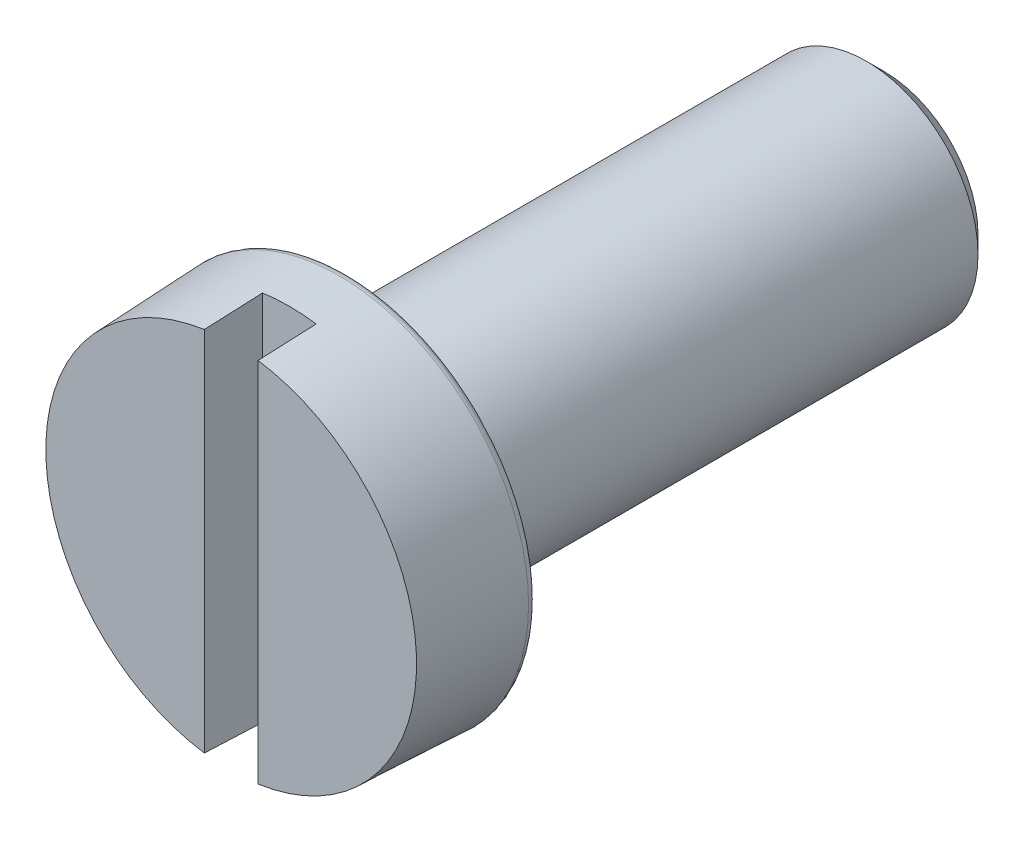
ISO-10303-21;
HEADER;
FILE_DESCRIPTION(('STEP AP214'),'2;1');
FILE_NAME('part.step','',(''),(''),'','','');
FILE_SCHEMA(('AUTOMOTIVE_DESIGN { 1 0 10303 214 1 1 1 1 }'));
ENDSEC;
DATA;
#1=APPLICATION_CONTEXT('core data for automotive mechanical design processes');
#2=APPLICATION_PROTOCOL_DEFINITION('international standard','automotive_design',2000,#1);
#3=PRODUCT_CONTEXT('',#1,'mechanical');
#4=PRODUCT('Part','Part','',(#3));
#5=PRODUCT_RELATED_PRODUCT_CATEGORY('part','',(#4));
#6=PRODUCT_DEFINITION_FORMATION('','',#4);
#7=PRODUCT_DEFINITION_CONTEXT('part definition',#1,'design');
#8=PRODUCT_DEFINITION('design','',#6,#7);
#9=PRODUCT_DEFINITION_SHAPE('','',#8);
#10=(LENGTH_UNIT() NAMED_UNIT(*) SI_UNIT(.MILLI.,.METRE.));
#11=(NAMED_UNIT(*) PLANE_ANGLE_UNIT() SI_UNIT($,.RADIAN.));
#12=(NAMED_UNIT(*) SI_UNIT($,.STERADIAN.) SOLID_ANGLE_UNIT());
#13=UNCERTAINTY_MEASURE_WITH_UNIT(LENGTH_MEASURE(1.E-05),#10,'distance_accuracy_value','');
#14=(GEOMETRIC_REPRESENTATION_CONTEXT(3) GLOBAL_UNCERTAINTY_ASSIGNED_CONTEXT((#13)) GLOBAL_UNIT_ASSIGNED_CONTEXT((#10,
#11,#12)) REPRESENTATION_CONTEXT('',''));
#15=CARTESIAN_POINT('',(0.,0.,0.));
#16=DIRECTION('',(0.,0.,1.));
#17=DIRECTION('',(1.,0.,0.));
#18=AXIS2_PLACEMENT_3D('',#15,#16,#17);
#19=CARTESIAN_POINT('',(0.,0.,2.6));
#20=DIRECTION('',(0.,0.,1.));
#21=DIRECTION('',(1.,0.,0.));
#22=AXIS2_PLACEMENT_3D('',#19,#20,#21);
#23=PLANE('',#22);
#24=DIRECTION('',(0.,1.,0.));
#25=VECTOR('',#24,1.);
#26=CARTESIAN_POINT('',(0.6,0.,2.6));
#27=LINE('',#26,#25);
#28=CARTESIAN_POINT('',(0.6,-4.10156030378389,2.6));
#29=VERTEX_POINT('',#28);
#30=CARTESIAN_POINT('',(0.6,4.10156030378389,2.6));
#31=VERTEX_POINT('',#30);
#32=EDGE_CURVE('E57',#29,#31,#27,.T.);
#33=ORIENTED_EDGE('',*,*,#32,.F.);
#34=CARTESIAN_POINT('',(0.,0.,2.6));
#35=DIRECTION('',(0.,0.,1.));
#36=DIRECTION('',(1.,0.,0.));
#37=AXIS2_PLACEMENT_3D('',#34,#35,#36);
#38=CIRCLE('',#37,4.14521373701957);
#39=EDGE_CURVE('E149',#29,#31,#38,.T.);
#40=ORIENTED_EDGE('',*,*,#39,.T.);
#41=EDGE_LOOP('',(#33,#40));
#42=FACE_BOUND('',#41,.T.);
#43=ADVANCED_FACE('F34',(#42),#23,.T.);
#44=DIRECTION('',(0.,-1.,0.));
#45=VECTOR('',#44,1.);
#46=CARTESIAN_POINT('',(-0.6,0.,2.6));
#47=LINE('',#46,#45);
#48=CARTESIAN_POINT('',(-0.6,4.10156030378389,2.6));
#49=VERTEX_POINT('',#48);
#50=CARTESIAN_POINT('',(-0.6,-4.10156030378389,2.6));
#51=VERTEX_POINT('',#50);
#52=EDGE_CURVE('E90',#49,#51,#47,.T.);
#53=ORIENTED_EDGE('',*,*,#52,.F.);
#54=EDGE_CURVE('E96',#49,#51,#38,.T.);
#55=ORIENTED_EDGE('',*,*,#54,.T.);
#56=EDGE_LOOP('',(#53,#55));
#57=FACE_BOUND('',#56,.T.);
#58=ADVANCED_FACE('F36',(#57),#23,.T.);
#59=CARTESIAN_POINT('',(0.,0.,-12.));
#60=DIRECTION('',(0.,0.,1.));
#61=DIRECTION('',(1.,0.,0.));
#62=AXIS2_PLACEMENT_3D('',#59,#60,#61);
#63=PLANE('',#62);
#64=CARTESIAN_POINT('',(0.,0.,-12.));
#65=DIRECTION('',(0.,0.,1.));
#66=DIRECTION('',(1.,0.,0.));
#67=AXIS2_PLACEMENT_3D('',#64,#65,#66);
#68=CIRCLE('',#67,2.1);
#69=CARTESIAN_POINT('',(2.1,0.,-12.));
#70=VERTEX_POINT('',#69);
#71=EDGE_CURVE('E11',#70,#70,#68,.F.);
#72=ORIENTED_EDGE('',*,*,#71,.T.);
#73=EDGE_LOOP('',(#72));
#74=FACE_BOUND('',#73,.T.);
#75=ADVANCED_FACE('F157',(#74),#63,.F.);
#76=CARTESIAN_POINT('',(0.,0.,0.));
#77=DIRECTION('',(0.,0.,1.));
#78=DIRECTION('',(1.,0.,0.));
#79=AXIS2_PLACEMENT_3D('',#76,#77,#78);
#80=CYLINDRICAL_SURFACE('',#79,2.5);
#81=CARTESIAN_POINT('',(0.,0.,-11.6));
#82=DIRECTION('',(0.,0.,1.));
#83=DIRECTION('',(1.,0.,0.));
#84=AXIS2_PLACEMENT_3D('',#81,#82,#83);
#85=CIRCLE('',#84,2.5);
#86=CARTESIAN_POINT('',(2.5,0.,-11.6));
#87=VERTEX_POINT('',#86);
#88=EDGE_CURVE('E42',#87,#87,#85,.T.);
#89=ORIENTED_EDGE('',*,*,#88,.T.);
#90=EDGE_LOOP('',(#89));
#91=FACE_BOUND('',#90,.T.);
#92=CARTESIAN_POINT('',(0.,0.,-0.433));
#93=DIRECTION('',(0.,0.,1.));
#94=DIRECTION('',(1.,0.,0.));
#95=AXIS2_PLACEMENT_3D('',#92,#93,#94);
#96=CIRCLE('',#95,2.5);
#97=CARTESIAN_POINT('',(2.5,0.,-0.433));
#98=VERTEX_POINT('',#97);
#99=EDGE_CURVE('E131',#98,#98,#96,.T.);
#100=ORIENTED_EDGE('',*,*,#99,.F.);
#101=EDGE_LOOP('',(#100));
#102=FACE_BOUND('',#101,.T.);
#103=ADVANCED_FACE('F162',(#91,#102),#80,.T.);
#104=CARTESIAN_POINT('',(0.,0.,-0.433));
#105=DIRECTION('',(0.,0.,1.));
#106=DIRECTION('',(1.,0.,0.));
#107=AXIS2_PLACEMENT_3D('',#104,#105,#106);
#108=TOROIDAL_SURFACE('',#107,2.7,0.2);
#109=ORIENTED_EDGE('',*,*,#99,.T.);
#110=EDGE_LOOP('',(#109));
#111=FACE_BOUND('',#110,.T.);
#112=CARTESIAN_POINT('',(0.,0.,-0.324739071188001));
#113=DIRECTION('',(0.,0.,1.));
#114=DIRECTION('',(1.,0.,0.));
#115=AXIS2_PLACEMENT_3D('',#112,#113,#114);
#116=CIRCLE('',#115,2.5318346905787);
#117=CARTESIAN_POINT('',(2.5318346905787,0.,-0.324739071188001));
#118=VERTEX_POINT('',#117);
#119=EDGE_CURVE('E134',#118,#118,#116,.T.);
#120=ORIENTED_EDGE('',*,*,#119,.F.);
#121=EDGE_LOOP('',(#120));
#122=FACE_BOUND('',#121,.T.);
#123=ADVANCED_FACE('F195',(#111,#122),#108,.F.);
#124=CARTESIAN_POINT('',(0.,0.,-0.324739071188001));
#125=DIRECTION('',(0.,0.,1.));
#126=DIRECTION('',(1.,0.,0.));
#127=AXIS2_PLACEMENT_3D('',#124,#125,#126);
#128=CONICAL_SURFACE('',#127,2.5318346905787,0.571987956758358);
#129=CARTESIAN_POINT('',(0.,0.,-0.0917390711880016));
#130=DIRECTION('',(0.,0.,1.));
#131=DIRECTION('',(1.,0.,0.));
#132=AXIS2_PLACEMENT_3D('',#129,#130,#131);
#133=CIRCLE('',#132,2.68183469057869);
#134=CARTESIAN_POINT('',(2.68183469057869,0.,-0.0917390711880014));
#135=VERTEX_POINT('',#134);
#136=EDGE_CURVE('E137',#135,#135,#133,.T.);
#137=ORIENTED_EDGE('',*,*,#136,.F.);
#138=EDGE_LOOP('',(#137));
#139=FACE_BOUND('',#138,.T.);
#140=ORIENTED_EDGE('',*,*,#119,.T.);
#141=EDGE_LOOP('',(#140));
#142=FACE_BOUND('',#141,.T.);
#143=ADVANCED_FACE('F191',(#139,#142),#128,.T.);
#144=CARTESIAN_POINT('',(0.,0.,-0.2));
#145=DIRECTION('',(0.,0.,1.));
#146=DIRECTION('',(1.,0.,0.));
#147=AXIS2_PLACEMENT_3D('',#144,#145,#146);
#148=TOROIDAL_SURFACE('',#147,2.85,0.2);
#149=ORIENTED_EDGE('',*,*,#136,.T.);
#150=EDGE_LOOP('',(#149));
#151=FACE_BOUND('',#150,.T.);
#152=CARTESIAN_POINT('',(0.,0.,0.));
#153=DIRECTION('',(0.,0.,1.));
#154=DIRECTION('',(1.,0.,0.));
#155=AXIS2_PLACEMENT_3D('',#152,#153,#154);
#156=CIRCLE('',#155,2.85);
#157=CARTESIAN_POINT('',(2.85,0.,0.));
#158=VERTEX_POINT('',#157);
#159=EDGE_CURVE('E140',#158,#158,#156,.T.);
#160=ORIENTED_EDGE('',*,*,#159,.F.);
#161=EDGE_LOOP('',(#160));
#162=FACE_BOUND('',#161,.T.);
#163=ADVANCED_FACE('F183',(#151,#162),#148,.F.);
#164=CARTESIAN_POINT('',(0.,2.85,0.));
#165=DIRECTION('',(0.,0.,1.));
#166=DIRECTION('',(1.,0.,0.));
#167=AXIS2_PLACEMENT_3D('',#164,#165,#166);
#168=PLANE('',#167);
#169=CARTESIAN_POINT('',(0.,0.,0.));
#170=DIRECTION('',(0.,0.,1.));
#171=DIRECTION('',(1.,0.,0.));
#172=AXIS2_PLACEMENT_3D('',#169,#170,#171);
#173=CIRCLE('',#172,4.05);
#174=CARTESIAN_POINT('',(4.05,0.,0.));
#175=VERTEX_POINT('',#174);
#176=EDGE_CURVE('E143',#175,#175,#173,.T.);
#177=ORIENTED_EDGE('',*,*,#176,.F.);
#178=EDGE_LOOP('',(#177));
#179=FACE_BOUND('',#178,.T.);
#180=ORIENTED_EDGE('',*,*,#159,.T.);
#181=EDGE_LOOP('',(#180));
#182=FACE_BOUND('',#181,.T.);
#183=ADVANCED_FACE('F178',(#179,#182),#168,.F.);
#184=CARTESIAN_POINT('',(0.,0.,0.2));
#185=DIRECTION('',(0.,0.,1.));
#186=DIRECTION('',(1.,0.,0.));
#187=AXIS2_PLACEMENT_3D('',#184,#185,#186);
#188=TOROIDAL_SURFACE('',#187,4.05,0.2);
#189=CARTESIAN_POINT('',(0.,0.,0.2));
#190=DIRECTION('',(0.,0.,1.));
#191=DIRECTION('',(1.,0.,0.));
#192=AXIS2_PLACEMENT_3D('',#189,#190,#191);
#193=CIRCLE('',#192,4.25);
#194=CARTESIAN_POINT('',(4.25,0.,0.2));
#195=VERTEX_POINT('',#194);
#196=EDGE_CURVE('E146',#195,#195,#193,.T.);
#197=ORIENTED_EDGE('',*,*,#196,.F.);
#198=EDGE_LOOP('',(#197));
#199=FACE_BOUND('',#198,.T.);
#200=ORIENTED_EDGE('',*,*,#176,.T.);
#201=EDGE_LOOP('',(#200));
#202=FACE_BOUND('',#201,.T.);
#203=ADVANCED_FACE('F172',(#199,#202),#188,.T.);
#204=CARTESIAN_POINT('',(0.,0.,0.2));
#205=DIRECTION('',(0.,0.,-1.));
#206=DIRECTION('',(-1.,0.,0.));
#207=AXIS2_PLACEMENT_3D('',#204,#205,#206);
#208=CONICAL_SURFACE('',#207,4.25,0.0436332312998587);
#209=CARTESIAN_POINT('',(0.,0.,1.3));
#210=DIRECTION('',(0.,0.,-1.));
#211=DIRECTION('',(-1.,0.,0.));
#212=AXIS2_PLACEMENT_3D('',#209,#210,#211);
#213=CIRCLE('',#212,4.20197296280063);
#214=CARTESIAN_POINT('',(-0.6,4.1589153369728,1.3));
#215=VERTEX_POINT('',#214);
#216=CARTESIAN_POINT('',(0.6,4.1589153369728,1.3));
#217=VERTEX_POINT('',#216);
#218=EDGE_CURVE('E74',#215,#217,#213,.T.);
#219=ORIENTED_EDGE('',*,*,#218,.T.);
#220=CARTESIAN_POINT('',(0.6,4.48049536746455,-5.99526208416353));
#221=CARTESIAN_POINT('',(0.6,4.3632332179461,-3.33290690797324));
#222=CARTESIAN_POINT('',(0.6,4.24586680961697,-0.67055633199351));
#223=CARTESIAN_POINT('',(0.6,4.01092547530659,4.65413562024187));
#224=CARTESIAN_POINT('',(0.6,3.89335054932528,7.31647699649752));
#225=CARTESIAN_POINT('',(0.6,3.77567136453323,9.97881377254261));
#226=B_SPLINE_CURVE_WITH_KNOTS('',3,(#220,#221,#222,#223,#224,#225),.UNSPECIFIED.,.F.,.F.,(4,2,
4),(0.,7.99480888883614,15.9896177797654),.UNSPECIFIED.);
#227=EDGE_CURVE('E97',#217,#31,#226,.T.);
#228=ORIENTED_EDGE('',*,*,#227,.T.);
#229=ORIENTED_EDGE('',*,*,#39,.F.);
#230=CARTESIAN_POINT('',(0.6,-3.77567136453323,9.97881377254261));
#231=CARTESIAN_POINT('',(0.6,-3.89335054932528,7.31647699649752));
#232=CARTESIAN_POINT('',(0.6,-4.01092547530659,4.65413562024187));
#233=CARTESIAN_POINT('',(0.6,-4.24586680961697,-0.67055633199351));
#234=CARTESIAN_POINT('',(0.6,-4.3632332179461,-3.33290690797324));
#235=CARTESIAN_POINT('',(0.6,-4.48049536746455,-5.99526208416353));
#236=B_SPLINE_CURVE_WITH_KNOTS('',3,(#230,#231,#232,#233,#234,#235),.UNSPECIFIED.,.F.,.F.,(4,2,
4),(0.,7.99480889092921,15.9896177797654),.UNSPECIFIED.);
#237=CARTESIAN_POINT('',(0.6,-4.1589153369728,1.3));
#238=VERTEX_POINT('',#237);
#239=EDGE_CURVE('E81',#29,#238,#236,.T.);
#240=ORIENTED_EDGE('',*,*,#239,.T.);
#241=CARTESIAN_POINT('',(-0.6,-4.1589153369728,1.3));
#242=VERTEX_POINT('',#241);
#243=EDGE_CURVE('E83',#238,#242,#213,.T.);
#244=ORIENTED_EDGE('',*,*,#243,.T.);
#245=CARTESIAN_POINT('',(-0.6,-4.48049536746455,-5.99526208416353));
#246=CARTESIAN_POINT('',(-0.6,-4.3632332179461,-3.33290690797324));
#247=CARTESIAN_POINT('',(-0.6,-4.24586680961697,-0.67055633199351));
#248=CARTESIAN_POINT('',(-0.6,-4.01092547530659,4.65413562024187));
#249=CARTESIAN_POINT('',(-0.6,-3.89335054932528,7.31647699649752));
#250=CARTESIAN_POINT('',(-0.6,-3.77567136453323,9.97881377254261));
#251=B_SPLINE_CURVE_WITH_KNOTS('',3,(#245,#246,#247,#248,#249,#250),.UNSPECIFIED.,.F.,.F.,(4,2,
4),(0.,7.99480888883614,15.9896177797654),.UNSPECIFIED.);
#252=EDGE_CURVE('E88',#242,#51,#251,.T.);
#253=ORIENTED_EDGE('',*,*,#252,.T.);
#254=ORIENTED_EDGE('',*,*,#54,.F.);
#255=CARTESIAN_POINT('',(-0.6,3.77567136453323,9.97881377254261));
#256=CARTESIAN_POINT('',(-0.6,3.89335054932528,7.31647699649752));
#257=CARTESIAN_POINT('',(-0.6,4.01092547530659,4.65413562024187));
#258=CARTESIAN_POINT('',(-0.6,4.24586680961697,-0.67055633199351));
#259=CARTESIAN_POINT('',(-0.6,4.3632332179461,-3.33290690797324));
#260=CARTESIAN_POINT('',(-0.6,4.48049536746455,-5.99526208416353));
#261=B_SPLINE_CURVE_WITH_KNOTS('',3,(#255,#256,#257,#258,#259,#260),.UNSPECIFIED.,.F.,.F.,(4,2,
4),(0.,7.99480889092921,15.9896177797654),.UNSPECIFIED.);
#262=EDGE_CURVE('E80',#49,#215,#261,.T.);
#263=ORIENTED_EDGE('',*,*,#262,.T.);
#264=EDGE_LOOP('',(#219,#228,#229,#240,#244,#253,#254,#263));
#265=FACE_BOUND('',#264,.T.);
#266=ORIENTED_EDGE('',*,*,#196,.T.);
#267=EDGE_LOOP('',(#266));
#268=FACE_BOUND('',#267,.T.);
#269=ADVANCED_FACE('F93',(#265,#268),#208,.T.);
#270=CARTESIAN_POINT('',(0.6,0.,1.95));
#271=DIRECTION('',(1.,0.,0.));
#272=DIRECTION('',(0.,0.,-1.));
#273=AXIS2_PLACEMENT_3D('',#270,#271,#272);
#274=PLANE('',#273);
#275=ORIENTED_EDGE('',*,*,#32,.T.);
#276=ORIENTED_EDGE('',*,*,#227,.F.);
#277=DIRECTION('',(0.,-1.,0.));
#278=VECTOR('',#277,1.);
#279=CARTESIAN_POINT('',(0.6,0.,1.3));
#280=LINE('',#279,#278);
#281=EDGE_CURVE('E77',#217,#238,#280,.T.);
#282=ORIENTED_EDGE('',*,*,#281,.T.);
#283=ORIENTED_EDGE('',*,*,#239,.F.);
#284=EDGE_LOOP('',(#275,#276,#282,#283));
#285=FACE_BOUND('',#284,.T.);
#286=ADVANCED_FACE('F123',(#285),#274,.F.);
#287=CARTESIAN_POINT('',(-0.6,0.,1.95));
#288=DIRECTION('',(-1.,0.,0.));
#289=DIRECTION('',(0.,0.,1.));
#290=AXIS2_PLACEMENT_3D('',#287,#288,#289);
#291=PLANE('',#290);
#292=DIRECTION('',(0.,1.,0.));
#293=VECTOR('',#292,1.);
#294=CARTESIAN_POINT('',(-0.6,0.,1.3));
#295=LINE('',#294,#293);
#296=EDGE_CURVE('E49',#242,#215,#295,.T.);
#297=ORIENTED_EDGE('',*,*,#296,.T.);
#298=ORIENTED_EDGE('',*,*,#262,.F.);
#299=ORIENTED_EDGE('',*,*,#52,.T.);
#300=ORIENTED_EDGE('',*,*,#252,.F.);
#301=EDGE_LOOP('',(#297,#298,#299,#300));
#302=FACE_BOUND('',#301,.T.);
#303=ADVANCED_FACE('F85',(#302),#291,.F.);
#304=CARTESIAN_POINT('',(-0.6,0.,1.3));
#305=DIRECTION('',(0.,0.,-1.));
#306=DIRECTION('',(-1.,0.,0.));
#307=AXIS2_PLACEMENT_3D('',#304,#305,#306);
#308=PLANE('',#307);
#309=ORIENTED_EDGE('',*,*,#296,.F.);
#310=ORIENTED_EDGE('',*,*,#243,.F.);
#311=ORIENTED_EDGE('',*,*,#281,.F.);
#312=ORIENTED_EDGE('',*,*,#218,.F.);
#313=EDGE_LOOP('',(#309,#310,#311,#312));
#314=FACE_BOUND('',#313,.T.);
#315=ADVANCED_FACE('F75',(#314),#308,.F.);
#316=CARTESIAN_POINT('',(0.,0.,-11.6));
#317=DIRECTION('',(0.,0.,1.));
#318=DIRECTION('',(1.,0.,0.));
#319=AXIS2_PLACEMENT_3D('',#316,#317,#318);
#320=CONICAL_SURFACE('',#319,2.5,0.785398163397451);
#321=ORIENTED_EDGE('',*,*,#71,.F.);
#322=EDGE_LOOP('',(#321));
#323=FACE_BOUND('',#322,.T.);
#324=ORIENTED_EDGE('',*,*,#88,.F.);
#325=EDGE_LOOP('',(#324));
#326=FACE_BOUND('',#325,.T.);
#327=ADVANCED_FACE('F124',(#323,#326),#320,.T.);
#328=CLOSED_SHELL('',(#43,#58,#75,#103,#123,#143,#163,#183,#203,#269,#286,#303,#315,#327));
#329=MANIFOLD_SOLID_BREP('B2',#328);
#330=ADVANCED_BREP_SHAPE_REPRESENTATION('',(#18,#329),#14);
#331=SHAPE_DEFINITION_REPRESENTATION(#9,#330);
ENDSEC;
END-ISO-10303-21;
